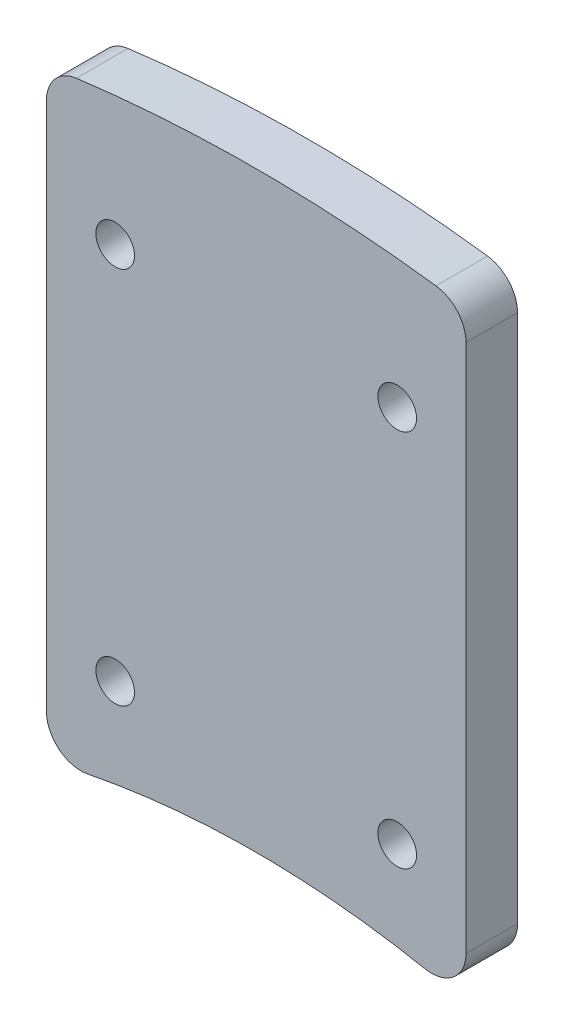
ISO-10303-21;
HEADER;
FILE_DESCRIPTION(('STEP AP214'),'2;1');
FILE_NAME('part.step','',(''),(''),'','','');
FILE_SCHEMA(('AUTOMOTIVE_DESIGN { 1 0 10303 214 1 1 1 1 }'));
ENDSEC;
DATA;
#1=APPLICATION_CONTEXT('core data for automotive mechanical design processes');
#2=APPLICATION_PROTOCOL_DEFINITION('international standard','automotive_design',2000,#1);
#3=PRODUCT_CONTEXT('',#1,'mechanical');
#4=PRODUCT('Part','Part','',(#3));
#5=PRODUCT_RELATED_PRODUCT_CATEGORY('part','',(#4));
#6=PRODUCT_DEFINITION_FORMATION('','',#4);
#7=PRODUCT_DEFINITION_CONTEXT('part definition',#1,'design');
#8=PRODUCT_DEFINITION('design','',#6,#7);
#9=PRODUCT_DEFINITION_SHAPE('','',#8);
#10=(LENGTH_UNIT() NAMED_UNIT(*) SI_UNIT(.MILLI.,.METRE.));
#11=(NAMED_UNIT(*) PLANE_ANGLE_UNIT() SI_UNIT($,.RADIAN.));
#12=(NAMED_UNIT(*) SI_UNIT($,.STERADIAN.) SOLID_ANGLE_UNIT());
#13=UNCERTAINTY_MEASURE_WITH_UNIT(LENGTH_MEASURE(1.E-05),#10,'distance_accuracy_value','');
#14=(GEOMETRIC_REPRESENTATION_CONTEXT(3) GLOBAL_UNCERTAINTY_ASSIGNED_CONTEXT((#13)) GLOBAL_UNIT_ASSIGNED_CONTEXT((#10,
#11,#12)) REPRESENTATION_CONTEXT('',''));
#15=CARTESIAN_POINT('',(0.,0.,0.));
#16=DIRECTION('',(0.,0.,1.));
#17=DIRECTION('',(1.,0.,0.));
#18=AXIS2_PLACEMENT_3D('',#15,#16,#17);
#19=CARTESIAN_POINT('',(77.47,0.,9.525));
#20=DIRECTION('',(-1.,0.,0.));
#21=DIRECTION('',(0.,-1.,0.));
#22=AXIS2_PLACEMENT_3D('',#19,#20,#21);
#23=PLANE('',#22);
#24=DIRECTION('',(0.,1.,0.));
#25=VECTOR('',#24,1.);
#26=CARTESIAN_POINT('',(77.47,0.,0.));
#27=LINE('',#26,#25);
#28=CARTESIAN_POINT('',(77.47,20.6124838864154,0.));
#29=VERTEX_POINT('',#28);
#30=CARTESIAN_POINT('',(77.47,118.304460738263,0.));
#31=VERTEX_POINT('',#30);
#32=EDGE_CURVE('E171',#29,#31,#27,.T.);
#33=ORIENTED_EDGE('',*,*,#32,.T.);
#34=DIRECTION('',(0.,0.,-1.));
#35=VECTOR('',#34,1.);
#36=CARTESIAN_POINT('',(77.47,118.304460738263,9.525));
#37=LINE('',#36,#35);
#38=CARTESIAN_POINT('',(77.47,118.304460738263,9.525));
#39=VERTEX_POINT('',#38);
#40=EDGE_CURVE('E103',#31,#39,#37,.F.);
#41=ORIENTED_EDGE('',*,*,#40,.T.);
#42=DIRECTION('',(0.,1.,0.));
#43=VECTOR('',#42,1.);
#44=CARTESIAN_POINT('',(77.47,0.,9.525));
#45=LINE('',#44,#43);
#46=CARTESIAN_POINT('',(77.47,20.6124838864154,9.525));
#47=VERTEX_POINT('',#46);
#48=EDGE_CURVE('E125',#47,#39,#45,.T.);
#49=ORIENTED_EDGE('',*,*,#48,.F.);
#50=DIRECTION('',(0.,0.,1.));
#51=VECTOR('',#50,1.);
#52=CARTESIAN_POINT('',(77.47,20.6124838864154,9.525));
#53=LINE('',#52,#51);
#54=EDGE_CURVE('E108',#47,#29,#53,.F.);
#55=ORIENTED_EDGE('',*,*,#54,.T.);
#56=EDGE_LOOP('',(#33,#41,#49,#55));
#57=FACE_BOUND('',#56,.T.);
#58=ADVANCED_FACE('F32',(#57),#23,.F.);
#59=CARTESIAN_POINT('',(0.,0.,9.525));
#60=DIRECTION('',(1.,0.,0.));
#61=DIRECTION('',(0.,1.,0.));
#62=AXIS2_PLACEMENT_3D('',#59,#60,#61);
#63=PLANE('',#62);
#64=DIRECTION('',(0.,-1.,0.));
#65=VECTOR('',#64,1.);
#66=CARTESIAN_POINT('',(0.,0.,9.525));
#67=LINE('',#66,#65);
#68=CARTESIAN_POINT('',(0.,118.304460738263,9.525));
#69=VERTEX_POINT('',#68);
#70=CARTESIAN_POINT('',(0.,20.6124838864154,9.525));
#71=VERTEX_POINT('',#70);
#72=EDGE_CURVE('E129',#69,#71,#67,.T.);
#73=ORIENTED_EDGE('',*,*,#72,.F.);
#74=DIRECTION('',(0.,0.,-1.));
#75=VECTOR('',#74,1.);
#76=CARTESIAN_POINT('',(0.,118.304460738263,9.525));
#77=LINE('',#76,#75);
#78=CARTESIAN_POINT('',(0.,118.304460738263,0.));
#79=VERTEX_POINT('',#78);
#80=EDGE_CURVE('E148',#69,#79,#77,.T.);
#81=ORIENTED_EDGE('',*,*,#80,.T.);
#82=DIRECTION('',(0.,-1.,0.));
#83=VECTOR('',#82,1.);
#84=CARTESIAN_POINT('',(0.,0.,0.));
#85=LINE('',#84,#83);
#86=CARTESIAN_POINT('',(0.,20.6124838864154,0.));
#87=VERTEX_POINT('',#86);
#88=EDGE_CURVE('E168',#79,#87,#85,.T.);
#89=ORIENTED_EDGE('',*,*,#88,.T.);
#90=DIRECTION('',(0.,0.,1.));
#91=VECTOR('',#90,1.);
#92=CARTESIAN_POINT('',(0.,20.6124838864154,9.525));
#93=LINE('',#92,#91);
#94=EDGE_CURVE('E145',#87,#71,#93,.T.);
#95=ORIENTED_EDGE('',*,*,#94,.T.);
#96=EDGE_LOOP('',(#73,#81,#89,#95));
#97=FACE_BOUND('',#96,.T.);
#98=ADVANCED_FACE('F34',(#97),#63,.F.);
#99=CARTESIAN_POINT('',(0.,139.7,9.525));
#100=DIRECTION('',(0.,0.,-1.));
#101=DIRECTION('',(-1.,0.,0.));
#102=AXIS2_PLACEMENT_3D('',#99,#100,#101);
#103=PLANE('',#102);
#104=CARTESIAN_POINT('',(64.77,101.6,9.525));
#105=DIRECTION('',(0.,0.,1.));
#106=DIRECTION('',(-1.,0.,0.));
#107=AXIS2_PLACEMENT_3D('',#104,#105,#106);
#108=CIRCLE('',#107,3.56870000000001);
#109=CARTESIAN_POINT('',(68.3387,101.6,9.525));
#110=VERTEX_POINT('',#109);
#111=EDGE_CURVE('E161',#110,#110,#108,.T.);
#112=ORIENTED_EDGE('',*,*,#111,.F.);
#113=EDGE_LOOP('',(#112));
#114=FACE_BOUND('',#113,.T.);
#115=CARTESIAN_POINT('',(12.7,31.75,9.525));
#116=DIRECTION('',(0.,0.,1.));
#117=DIRECTION('',(1.,0.,0.));
#118=AXIS2_PLACEMENT_3D('',#115,#116,#117);
#119=CIRCLE('',#118,3.5687);
#120=CARTESIAN_POINT('',(16.2687,31.75,9.525));
#121=VERTEX_POINT('',#120);
#122=EDGE_CURVE('E190',#121,#121,#119,.T.);
#123=ORIENTED_EDGE('',*,*,#122,.F.);
#124=EDGE_LOOP('',(#123));
#125=FACE_BOUND('',#124,.T.);
#126=CARTESIAN_POINT('',(64.77,31.75,9.525));
#127=DIRECTION('',(0.,0.,1.));
#128=DIRECTION('',(-1.,0.,0.));
#129=AXIS2_PLACEMENT_3D('',#126,#127,#128);
#130=CIRCLE('',#129,3.56870000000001);
#131=CARTESIAN_POINT('',(68.3387,31.75,9.525));
#132=VERTEX_POINT('',#131);
#133=EDGE_CURVE('E184',#132,#132,#130,.T.);
#134=ORIENTED_EDGE('',*,*,#133,.F.);
#135=EDGE_LOOP('',(#134));
#136=FACE_BOUND('',#135,.T.);
#137=CARTESIAN_POINT('',(12.7,101.6,9.525));
#138=DIRECTION('',(0.,0.,1.));
#139=DIRECTION('',(1.,0.,0.));
#140=AXIS2_PLACEMENT_3D('',#137,#138,#139);
#141=CIRCLE('',#140,3.5687);
#142=CARTESIAN_POINT('',(16.2687,101.6,9.525));
#143=VERTEX_POINT('',#142);
#144=EDGE_CURVE('E178',#143,#143,#141,.T.);
#145=ORIENTED_EDGE('',*,*,#144,.F.);
#146=EDGE_LOOP('',(#145));
#147=FACE_BOUND('',#146,.T.);
#148=ORIENTED_EDGE('',*,*,#48,.T.);
#149=CARTESIAN_POINT('',(71.12,118.304460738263,9.525));
#150=DIRECTION('',(0.,0.,-1.));
#151=DIRECTION('',(-1.,0.,0.));
#152=AXIS2_PLACEMENT_3D('',#149,#150,#151);
#153=CIRCLE('',#152,6.35);
#154=CARTESIAN_POINT('',(71.9347169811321,124.60197899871,9.525));
#155=VERTEX_POINT('',#154);
#156=EDGE_CURVE('E143',#39,#155,#153,.F.);
#157=ORIENTED_EDGE('',*,*,#156,.T.);
#158=CARTESIAN_POINT('',(38.735,-132.021890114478,9.525));
#159=DIRECTION('',(0.,0.,1.));
#160=DIRECTION('',(1.,0.,0.));
#161=AXIS2_PLACEMENT_3D('',#158,#159,#160);
#162=CIRCLE('',#161,258.7625);
#163=CARTESIAN_POINT('',(5.53528301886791,124.60197899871,9.525));
#164=VERTEX_POINT('',#163);
#165=EDGE_CURVE('E118',#155,#164,#162,.T.);
#166=ORIENTED_EDGE('',*,*,#165,.T.);
#167=CARTESIAN_POINT('',(6.34999999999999,118.304460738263,9.525));
#168=DIRECTION('',(0.,0.,-1.));
#169=DIRECTION('',(-1.,0.,0.));
#170=AXIS2_PLACEMENT_3D('',#167,#168,#169);
#171=CIRCLE('',#170,6.35);
#172=EDGE_CURVE('E141',#164,#69,#171,.F.);
#173=ORIENTED_EDGE('',*,*,#172,.T.);
#174=ORIENTED_EDGE('',*,*,#72,.T.);
#175=CARTESIAN_POINT('',(6.35000000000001,20.6124838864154,9.525));
#176=DIRECTION('',(0.,0.,-1.));
#177=DIRECTION('',(-1.,0.,0.));
#178=AXIS2_PLACEMENT_3D('',#175,#176,#177);
#179=CIRCLE('',#178,6.35);
#180=CARTESIAN_POINT('',(7.57670454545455,14.3820989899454,9.525));
#181=VERTEX_POINT('',#180);
#182=EDGE_CURVE('E47',#71,#181,#179,.F.);
#183=ORIENTED_EDGE('',*,*,#182,.T.);
#184=CARTESIAN_POINT('',(38.735,-143.869677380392,9.525));
#185=DIRECTION('',(0.,0.,1.));
#186=DIRECTION('',(1.,0.,0.));
#187=AXIS2_PLACEMENT_3D('',#184,#185,#186);
#188=CIRCLE('',#187,161.29);
#189=CARTESIAN_POINT('',(69.8932954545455,14.3820989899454,9.525));
#190=VERTEX_POINT('',#189);
#191=EDGE_CURVE('E156',#190,#181,#188,.T.);
#192=ORIENTED_EDGE('',*,*,#191,.F.);
#193=CARTESIAN_POINT('',(71.12,20.6124838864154,9.525));
#194=DIRECTION('',(0.,0.,-1.));
#195=DIRECTION('',(-1.,0.,0.));
#196=AXIS2_PLACEMENT_3D('',#193,#194,#195);
#197=CIRCLE('',#196,6.35);
#198=EDGE_CURVE('E55',#190,#47,#197,.F.);
#199=ORIENTED_EDGE('',*,*,#198,.T.);
#200=EDGE_LOOP('',(#148,#157,#166,#173,#174,#183,#192,#199));
#201=FACE_BOUND('',#200,.T.);
#202=ADVANCED_FACE('F169',(#114,#125,#136,#147,#201),#103,.F.);
#203=CARTESIAN_POINT('',(0.,139.7,0.));
#204=DIRECTION('',(0.,0.,-1.));
#205=DIRECTION('',(-1.,0.,0.));
#206=AXIS2_PLACEMENT_3D('',#203,#204,#205);
#207=PLANE('',#206);
#208=CARTESIAN_POINT('',(38.735,-132.021890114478,0.));
#209=DIRECTION('',(0.,0.,-1.));
#210=DIRECTION('',(-1.,0.,0.));
#211=AXIS2_PLACEMENT_3D('',#208,#209,#210);
#212=CIRCLE('',#211,258.7625);
#213=CARTESIAN_POINT('',(71.9347169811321,124.60197899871,0.));
#214=VERTEX_POINT('',#213);
#215=CARTESIAN_POINT('',(5.53528301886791,124.60197899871,0.));
#216=VERTEX_POINT('',#215);
#217=EDGE_CURVE('E115',#214,#216,#212,.F.);
#218=ORIENTED_EDGE('',*,*,#217,.F.);
#219=CARTESIAN_POINT('',(71.12,118.304460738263,0.));
#220=DIRECTION('',(0.,0.,-1.));
#221=DIRECTION('',(-1.,0.,0.));
#222=AXIS2_PLACEMENT_3D('',#219,#220,#221);
#223=CIRCLE('',#222,6.35);
#224=EDGE_CURVE('E98',#214,#31,#223,.T.);
#225=ORIENTED_EDGE('',*,*,#224,.T.);
#226=ORIENTED_EDGE('',*,*,#32,.F.);
#227=CARTESIAN_POINT('',(71.12,20.6124838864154,0.));
#228=DIRECTION('',(0.,0.,-1.));
#229=DIRECTION('',(-1.,0.,0.));
#230=AXIS2_PLACEMENT_3D('',#227,#228,#229);
#231=CIRCLE('',#230,6.35);
#232=CARTESIAN_POINT('',(69.8932954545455,14.3820989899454,0.));
#233=VERTEX_POINT('',#232);
#234=EDGE_CURVE('E134',#29,#233,#231,.T.);
#235=ORIENTED_EDGE('',*,*,#234,.T.);
#236=CARTESIAN_POINT('',(38.735,-143.869677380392,0.));
#237=DIRECTION('',(0.,0.,1.));
#238=DIRECTION('',(1.,0.,0.));
#239=AXIS2_PLACEMENT_3D('',#236,#237,#238);
#240=CIRCLE('',#239,161.29);
#241=CARTESIAN_POINT('',(7.57670454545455,14.3820989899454,0.));
#242=VERTEX_POINT('',#241);
#243=EDGE_CURVE('E155',#233,#242,#240,.T.);
#244=ORIENTED_EDGE('',*,*,#243,.T.);
#245=CARTESIAN_POINT('',(6.35000000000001,20.6124838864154,0.));
#246=DIRECTION('',(0.,0.,-1.));
#247=DIRECTION('',(-1.,0.,0.));
#248=AXIS2_PLACEMENT_3D('',#245,#246,#247);
#249=CIRCLE('',#248,6.35);
#250=EDGE_CURVE('E119',#242,#87,#249,.T.);
#251=ORIENTED_EDGE('',*,*,#250,.T.);
#252=ORIENTED_EDGE('',*,*,#88,.F.);
#253=CARTESIAN_POINT('',(6.34999999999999,118.304460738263,0.));
#254=DIRECTION('',(0.,0.,-1.));
#255=DIRECTION('',(-1.,0.,0.));
#256=AXIS2_PLACEMENT_3D('',#253,#254,#255);
#257=CIRCLE('',#256,6.35);
#258=EDGE_CURVE('E109',#79,#216,#257,.T.);
#259=ORIENTED_EDGE('',*,*,#258,.T.);
#260=EDGE_LOOP('',(#218,#225,#226,#235,#244,#251,#252,#259));
#261=FACE_BOUND('',#260,.T.);
#262=CARTESIAN_POINT('',(64.77,101.6,0.));
#263=DIRECTION('',(0.,0.,1.));
#264=DIRECTION('',(-1.,0.,0.));
#265=AXIS2_PLACEMENT_3D('',#262,#263,#264);
#266=CIRCLE('',#265,3.56870000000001);
#267=CARTESIAN_POINT('',(68.3387,101.6,0.));
#268=VERTEX_POINT('',#267);
#269=EDGE_CURVE('E193',#268,#268,#266,.T.);
#270=ORIENTED_EDGE('',*,*,#269,.T.);
#271=EDGE_LOOP('',(#270));
#272=FACE_BOUND('',#271,.T.);
#273=CARTESIAN_POINT('',(12.7,31.75,0.));
#274=DIRECTION('',(0.,0.,1.));
#275=DIRECTION('',(1.,0.,0.));
#276=AXIS2_PLACEMENT_3D('',#273,#274,#275);
#277=CIRCLE('',#276,3.5687);
#278=CARTESIAN_POINT('',(16.2687,31.75,0.));
#279=VERTEX_POINT('',#278);
#280=EDGE_CURVE('E187',#279,#279,#277,.T.);
#281=ORIENTED_EDGE('',*,*,#280,.T.);
#282=EDGE_LOOP('',(#281));
#283=FACE_BOUND('',#282,.T.);
#284=CARTESIAN_POINT('',(64.77,31.75,0.));
#285=DIRECTION('',(0.,0.,1.));
#286=DIRECTION('',(-1.,0.,0.));
#287=AXIS2_PLACEMENT_3D('',#284,#285,#286);
#288=CIRCLE('',#287,3.56870000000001);
#289=CARTESIAN_POINT('',(68.3387,31.75,0.));
#290=VERTEX_POINT('',#289);
#291=EDGE_CURVE('E181',#290,#290,#288,.T.);
#292=ORIENTED_EDGE('',*,*,#291,.T.);
#293=EDGE_LOOP('',(#292));
#294=FACE_BOUND('',#293,.T.);
#295=CARTESIAN_POINT('',(12.7,101.6,0.));
#296=DIRECTION('',(0.,0.,1.));
#297=DIRECTION('',(1.,0.,0.));
#298=AXIS2_PLACEMENT_3D('',#295,#296,#297);
#299=CIRCLE('',#298,3.5687);
#300=CARTESIAN_POINT('',(16.2687,101.6,0.));
#301=VERTEX_POINT('',#300);
#302=EDGE_CURVE('E175',#301,#301,#299,.T.);
#303=ORIENTED_EDGE('',*,*,#302,.T.);
#304=EDGE_LOOP('',(#303));
#305=FACE_BOUND('',#304,.T.);
#306=ADVANCED_FACE('F122',(#261,#272,#283,#294,#305),#207,.T.);
#307=CARTESIAN_POINT('',(12.7,101.6,0.));
#308=DIRECTION('',(0.,0.,1.));
#309=DIRECTION('',(1.,0.,0.));
#310=AXIS2_PLACEMENT_3D('',#307,#308,#309);
#311=CYLINDRICAL_SURFACE('',#310,3.5687);
#312=CARTESIAN_POINT('',(16.2687,101.6,0.));
#313=CARTESIAN_POINT('',(16.2687,101.6,0.0992187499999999));
#314=CARTESIAN_POINT('',(16.2687,101.6,0.1984375));
#315=CARTESIAN_POINT('',(16.2687,101.6,0.396875));
#316=CARTESIAN_POINT('',(16.2687,101.6,0.49609375));
#317=CARTESIAN_POINT('',(16.2687,101.6,0.69453125));
#318=CARTESIAN_POINT('',(16.2687,101.6,0.79375));
#319=CARTESIAN_POINT('',(16.2687,101.6,0.9921875));
#320=CARTESIAN_POINT('',(16.2687,101.6,1.09140625));
#321=CARTESIAN_POINT('',(16.2687,101.6,1.28984375));
#322=CARTESIAN_POINT('',(16.2687,101.6,1.3890625));
#323=CARTESIAN_POINT('',(16.2687,101.6,1.5875));
#324=CARTESIAN_POINT('',(16.2687,101.6,1.68671875));
#325=CARTESIAN_POINT('',(16.2687,101.6,1.88515625));
#326=CARTESIAN_POINT('',(16.2687,101.6,1.984375));
#327=CARTESIAN_POINT('',(16.2687,101.6,2.1828125));
#328=CARTESIAN_POINT('',(16.2687,101.6,2.28203125));
#329=CARTESIAN_POINT('',(16.2687,101.6,2.48046875));
#330=CARTESIAN_POINT('',(16.2687,101.6,2.5796875));
#331=CARTESIAN_POINT('',(16.2687,101.6,2.778125));
#332=CARTESIAN_POINT('',(16.2687,101.6,2.87734375));
#333=CARTESIAN_POINT('',(16.2687,101.6,3.07578125));
#334=CARTESIAN_POINT('',(16.2687,101.6,3.175));
#335=CARTESIAN_POINT('',(16.2687,101.6,3.3734375));
#336=CARTESIAN_POINT('',(16.2687,101.6,3.47265625));
#337=CARTESIAN_POINT('',(16.2687,101.6,3.67109375));
#338=CARTESIAN_POINT('',(16.2687,101.6,3.7703125));
#339=CARTESIAN_POINT('',(16.2687,101.6,3.96875));
#340=CARTESIAN_POINT('',(16.2687,101.6,4.06796875));
#341=CARTESIAN_POINT('',(16.2687,101.6,4.26640625));
#342=CARTESIAN_POINT('',(16.2687,101.6,4.365625));
#343=CARTESIAN_POINT('',(16.2687,101.6,4.5640625));
#344=CARTESIAN_POINT('',(16.2687,101.6,4.66328125));
#345=CARTESIAN_POINT('',(16.2687,101.6,4.86171875));
#346=CARTESIAN_POINT('',(16.2687,101.6,4.9609375));
#347=CARTESIAN_POINT('',(16.2687,101.6,5.159375));
#348=CARTESIAN_POINT('',(16.2687,101.6,5.25859375));
#349=CARTESIAN_POINT('',(16.2687,101.6,5.45703125));
#350=CARTESIAN_POINT('',(16.2687,101.6,5.55625));
#351=CARTESIAN_POINT('',(16.2687,101.6,5.7546875));
#352=CARTESIAN_POINT('',(16.2687,101.6,5.85390625));
#353=CARTESIAN_POINT('',(16.2687,101.6,6.05234375));
#354=CARTESIAN_POINT('',(16.2687,101.6,6.1515625));
#355=CARTESIAN_POINT('',(16.2687,101.6,6.35));
#356=CARTESIAN_POINT('',(16.2687,101.6,6.44921875));
#357=CARTESIAN_POINT('',(16.2687,101.6,6.64765625));
#358=CARTESIAN_POINT('',(16.2687,101.6,6.746875));
#359=CARTESIAN_POINT('',(16.2687,101.6,6.9453125));
#360=CARTESIAN_POINT('',(16.2687,101.6,7.04453125));
#361=CARTESIAN_POINT('',(16.2687,101.6,7.24296875));
#362=CARTESIAN_POINT('',(16.2687,101.6,7.3421875));
#363=CARTESIAN_POINT('',(16.2687,101.6,7.540625));
#364=CARTESIAN_POINT('',(16.2687,101.6,7.63984375));
#365=CARTESIAN_POINT('',(16.2687,101.6,7.83828125));
#366=CARTESIAN_POINT('',(16.2687,101.6,7.9375));
#367=CARTESIAN_POINT('',(16.2687,101.6,8.1359375));
#368=CARTESIAN_POINT('',(16.2687,101.6,8.23515625));
#369=CARTESIAN_POINT('',(16.2687,101.6,8.43359375));
#370=CARTESIAN_POINT('',(16.2687,101.6,8.5328125));
#371=CARTESIAN_POINT('',(16.2687,101.6,8.73125));
#372=CARTESIAN_POINT('',(16.2687,101.6,8.83046875));
#373=CARTESIAN_POINT('',(16.2687,101.6,9.02890625));
#374=CARTESIAN_POINT('',(16.2687,101.6,9.128125));
#375=CARTESIAN_POINT('',(16.2687,101.6,9.3265625));
#376=CARTESIAN_POINT('',(16.2687,101.6,9.42578125));
#377=CARTESIAN_POINT('',(16.2687,101.6,9.525));
#378=B_SPLINE_CURVE_WITH_KNOTS('',3,(#312,#313,#314,#315,#316,#317,#318,#319,#320,#321,#322,
#323,#324,#325,#326,#327,#328,#329,#330,#331,#332,#333,#334,#335,#336,#337,#338,#339,#340,#341,
#342,#343,#344,#345,#346,#347,#348,#349,#350,#351,#352,#353,#354,#355,#356,#357,#358,#359,#360,
#361,#362,#363,#364,#365,#366,#367,#368,#369,#370,#371,#372,#373,#374,#375,#376,#377),
.UNSPECIFIED.,.F.,.F.,(4,2,2,2,2,2,2,2,2,2,2,2,2,2,2,2,2,2,2,2,2,2,2,2,2,2,2,2,2,2,2,2,4),(0.,
0.29765625,0.5953125,0.89296875,1.190625,1.48828125,1.7859375,2.08359375,2.38125,2.67890625,
2.9765625,3.27421875,3.571875,3.86953125,4.1671875,4.46484375,4.7625,5.06015625,5.3578125,
5.65546875,5.953125,6.25078125,6.5484375,6.84609375,7.14375,7.44140625,7.7390625,8.03671875,
8.334375,8.63203125,8.9296875,9.22734375,9.525),.UNSPECIFIED.);
#379=EDGE_CURVE('BSEAM221',#301,#143,#378,.T.);
#380=ORIENTED_EDGE('',*,*,#302,.F.);
#381=ORIENTED_EDGE('',*,*,#144,.T.);
#382=ORIENTED_EDGE('',*,*,#379,.T.);
#383=ORIENTED_EDGE('',*,*,#379,.F.);
#384=EDGE_LOOP('',(#380,#382,#381,#383));
#385=FACE_BOUND('',#384,.T.);
#386=ADVANCED_FACE('F221',(#385),#311,.F.);
#387=CARTESIAN_POINT('',(64.77,31.75,0.));
#388=DIRECTION('',(0.,0.,1.));
#389=DIRECTION('',(1.,0.,0.));
#390=AXIS2_PLACEMENT_3D('',#387,#388,#389);
#391=CYLINDRICAL_SURFACE('',#390,3.56870000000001);
#392=CARTESIAN_POINT('',(68.3387,31.75,0.));
#393=CARTESIAN_POINT('',(68.3387,31.75,0.0992187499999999));
#394=CARTESIAN_POINT('',(68.3387,31.75,0.1984375));
#395=CARTESIAN_POINT('',(68.3387,31.75,0.396875));
#396=CARTESIAN_POINT('',(68.3387,31.75,0.49609375));
#397=CARTESIAN_POINT('',(68.3387,31.75,0.69453125));
#398=CARTESIAN_POINT('',(68.3387,31.75,0.79375));
#399=CARTESIAN_POINT('',(68.3387,31.75,0.9921875));
#400=CARTESIAN_POINT('',(68.3387,31.75,1.09140625));
#401=CARTESIAN_POINT('',(68.3387,31.75,1.28984375));
#402=CARTESIAN_POINT('',(68.3387,31.75,1.3890625));
#403=CARTESIAN_POINT('',(68.3387,31.75,1.5875));
#404=CARTESIAN_POINT('',(68.3387,31.75,1.68671875));
#405=CARTESIAN_POINT('',(68.3387,31.75,1.88515625));
#406=CARTESIAN_POINT('',(68.3387,31.75,1.984375));
#407=CARTESIAN_POINT('',(68.3387,31.75,2.1828125));
#408=CARTESIAN_POINT('',(68.3387,31.75,2.28203125));
#409=CARTESIAN_POINT('',(68.3387,31.75,2.48046875));
#410=CARTESIAN_POINT('',(68.3387,31.75,2.5796875));
#411=CARTESIAN_POINT('',(68.3387,31.75,2.778125));
#412=CARTESIAN_POINT('',(68.3387,31.75,2.87734375));
#413=CARTESIAN_POINT('',(68.3387,31.75,3.07578125));
#414=CARTESIAN_POINT('',(68.3387,31.75,3.175));
#415=CARTESIAN_POINT('',(68.3387,31.75,3.3734375));
#416=CARTESIAN_POINT('',(68.3387,31.75,3.47265625));
#417=CARTESIAN_POINT('',(68.3387,31.75,3.67109375));
#418=CARTESIAN_POINT('',(68.3387,31.75,3.7703125));
#419=CARTESIAN_POINT('',(68.3387,31.75,3.96875));
#420=CARTESIAN_POINT('',(68.3387,31.75,4.06796875));
#421=CARTESIAN_POINT('',(68.3387,31.75,4.26640625));
#422=CARTESIAN_POINT('',(68.3387,31.75,4.365625));
#423=CARTESIAN_POINT('',(68.3387,31.75,4.5640625));
#424=CARTESIAN_POINT('',(68.3387,31.75,4.66328125));
#425=CARTESIAN_POINT('',(68.3387,31.75,4.86171875));
#426=CARTESIAN_POINT('',(68.3387,31.75,4.9609375));
#427=CARTESIAN_POINT('',(68.3387,31.75,5.159375));
#428=CARTESIAN_POINT('',(68.3387,31.75,5.25859375));
#429=CARTESIAN_POINT('',(68.3387,31.75,5.45703125));
#430=CARTESIAN_POINT('',(68.3387,31.75,5.55625));
#431=CARTESIAN_POINT('',(68.3387,31.75,5.7546875));
#432=CARTESIAN_POINT('',(68.3387,31.75,5.85390625));
#433=CARTESIAN_POINT('',(68.3387,31.75,6.05234375));
#434=CARTESIAN_POINT('',(68.3387,31.75,6.1515625));
#435=CARTESIAN_POINT('',(68.3387,31.75,6.35));
#436=CARTESIAN_POINT('',(68.3387,31.75,6.44921875));
#437=CARTESIAN_POINT('',(68.3387,31.75,6.64765625));
#438=CARTESIAN_POINT('',(68.3387,31.75,6.746875));
#439=CARTESIAN_POINT('',(68.3387,31.75,6.9453125));
#440=CARTESIAN_POINT('',(68.3387,31.75,7.04453125));
#441=CARTESIAN_POINT('',(68.3387,31.75,7.24296875));
#442=CARTESIAN_POINT('',(68.3387,31.75,7.3421875));
#443=CARTESIAN_POINT('',(68.3387,31.75,7.540625));
#444=CARTESIAN_POINT('',(68.3387,31.75,7.63984375));
#445=CARTESIAN_POINT('',(68.3387,31.75,7.83828125));
#446=CARTESIAN_POINT('',(68.3387,31.75,7.9375));
#447=CARTESIAN_POINT('',(68.3387,31.75,8.1359375));
#448=CARTESIAN_POINT('',(68.3387,31.75,8.23515625));
#449=CARTESIAN_POINT('',(68.3387,31.75,8.43359375));
#450=CARTESIAN_POINT('',(68.3387,31.75,8.5328125));
#451=CARTESIAN_POINT('',(68.3387,31.75,8.73125));
#452=CARTESIAN_POINT('',(68.3387,31.75,8.83046875));
#453=CARTESIAN_POINT('',(68.3387,31.75,9.02890625));
#454=CARTESIAN_POINT('',(68.3387,31.75,9.128125));
#455=CARTESIAN_POINT('',(68.3387,31.75,9.3265625));
#456=CARTESIAN_POINT('',(68.3387,31.75,9.42578125));
#457=CARTESIAN_POINT('',(68.3387,31.75,9.525));
#458=B_SPLINE_CURVE_WITH_KNOTS('',3,(#392,#393,#394,#395,#396,#397,#398,#399,#400,#401,#402,
#403,#404,#405,#406,#407,#408,#409,#410,#411,#412,#413,#414,#415,#416,#417,#418,#419,#420,#421,
#422,#423,#424,#425,#426,#427,#428,#429,#430,#431,#432,#433,#434,#435,#436,#437,#438,#439,#440,
#441,#442,#443,#444,#445,#446,#447,#448,#449,#450,#451,#452,#453,#454,#455,#456,#457),
.UNSPECIFIED.,.F.,.F.,(4,2,2,2,2,2,2,2,2,2,2,2,2,2,2,2,2,2,2,2,2,2,2,2,2,2,2,2,2,2,2,2,4),(0.,
0.29765625,0.5953125,0.89296875,1.190625,1.48828125,1.7859375,2.08359375,2.38125,2.67890625,
2.9765625,3.27421875,3.571875,3.86953125,4.1671875,4.46484375,4.7625,5.06015625,5.3578125,
5.65546875,5.953125,6.25078125,6.5484375,6.84609375,7.14375,7.44140625,7.7390625,8.03671875,
8.334375,8.63203125,8.9296875,9.22734375,9.525),.UNSPECIFIED.);
#459=EDGE_CURVE('BSEAM224',#290,#132,#458,.T.);
#460=ORIENTED_EDGE('',*,*,#291,.F.);
#461=ORIENTED_EDGE('',*,*,#133,.T.);
#462=ORIENTED_EDGE('',*,*,#459,.T.);
#463=ORIENTED_EDGE('',*,*,#459,.F.);
#464=EDGE_LOOP('',(#460,#462,#461,#463));
#465=FACE_BOUND('',#464,.T.);
#466=ADVANCED_FACE('F224',(#465),#391,.F.);
#467=CARTESIAN_POINT('',(12.7,31.75,0.));
#468=DIRECTION('',(0.,0.,1.));
#469=DIRECTION('',(1.,0.,0.));
#470=AXIS2_PLACEMENT_3D('',#467,#468,#469);
#471=CYLINDRICAL_SURFACE('',#470,3.5687);
#472=CARTESIAN_POINT('',(16.2687,31.75,0.));
#473=CARTESIAN_POINT('',(16.2687,31.75,0.0992187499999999));
#474=CARTESIAN_POINT('',(16.2687,31.75,0.1984375));
#475=CARTESIAN_POINT('',(16.2687,31.75,0.396875));
#476=CARTESIAN_POINT('',(16.2687,31.75,0.49609375));
#477=CARTESIAN_POINT('',(16.2687,31.75,0.69453125));
#478=CARTESIAN_POINT('',(16.2687,31.75,0.79375));
#479=CARTESIAN_POINT('',(16.2687,31.75,0.9921875));
#480=CARTESIAN_POINT('',(16.2687,31.75,1.09140625));
#481=CARTESIAN_POINT('',(16.2687,31.75,1.28984375));
#482=CARTESIAN_POINT('',(16.2687,31.75,1.3890625));
#483=CARTESIAN_POINT('',(16.2687,31.75,1.5875));
#484=CARTESIAN_POINT('',(16.2687,31.75,1.68671875));
#485=CARTESIAN_POINT('',(16.2687,31.75,1.88515625));
#486=CARTESIAN_POINT('',(16.2687,31.75,1.984375));
#487=CARTESIAN_POINT('',(16.2687,31.75,2.1828125));
#488=CARTESIAN_POINT('',(16.2687,31.75,2.28203125));
#489=CARTESIAN_POINT('',(16.2687,31.75,2.48046875));
#490=CARTESIAN_POINT('',(16.2687,31.75,2.5796875));
#491=CARTESIAN_POINT('',(16.2687,31.75,2.778125));
#492=CARTESIAN_POINT('',(16.2687,31.75,2.87734375));
#493=CARTESIAN_POINT('',(16.2687,31.75,3.07578125));
#494=CARTESIAN_POINT('',(16.2687,31.75,3.175));
#495=CARTESIAN_POINT('',(16.2687,31.75,3.3734375));
#496=CARTESIAN_POINT('',(16.2687,31.75,3.47265625));
#497=CARTESIAN_POINT('',(16.2687,31.75,3.67109375));
#498=CARTESIAN_POINT('',(16.2687,31.75,3.7703125));
#499=CARTESIAN_POINT('',(16.2687,31.75,3.96875));
#500=CARTESIAN_POINT('',(16.2687,31.75,4.06796875));
#501=CARTESIAN_POINT('',(16.2687,31.75,4.26640625));
#502=CARTESIAN_POINT('',(16.2687,31.75,4.365625));
#503=CARTESIAN_POINT('',(16.2687,31.75,4.5640625));
#504=CARTESIAN_POINT('',(16.2687,31.75,4.66328125));
#505=CARTESIAN_POINT('',(16.2687,31.75,4.86171875));
#506=CARTESIAN_POINT('',(16.2687,31.75,4.9609375));
#507=CARTESIAN_POINT('',(16.2687,31.75,5.159375));
#508=CARTESIAN_POINT('',(16.2687,31.75,5.25859375));
#509=CARTESIAN_POINT('',(16.2687,31.75,5.45703125));
#510=CARTESIAN_POINT('',(16.2687,31.75,5.55625));
#511=CARTESIAN_POINT('',(16.2687,31.75,5.7546875));
#512=CARTESIAN_POINT('',(16.2687,31.75,5.85390625));
#513=CARTESIAN_POINT('',(16.2687,31.75,6.05234375));
#514=CARTESIAN_POINT('',(16.2687,31.75,6.1515625));
#515=CARTESIAN_POINT('',(16.2687,31.75,6.35));
#516=CARTESIAN_POINT('',(16.2687,31.75,6.44921875));
#517=CARTESIAN_POINT('',(16.2687,31.75,6.64765625));
#518=CARTESIAN_POINT('',(16.2687,31.75,6.746875));
#519=CARTESIAN_POINT('',(16.2687,31.75,6.9453125));
#520=CARTESIAN_POINT('',(16.2687,31.75,7.04453125));
#521=CARTESIAN_POINT('',(16.2687,31.75,7.24296875));
#522=CARTESIAN_POINT('',(16.2687,31.75,7.3421875));
#523=CARTESIAN_POINT('',(16.2687,31.75,7.540625));
#524=CARTESIAN_POINT('',(16.2687,31.75,7.63984375));
#525=CARTESIAN_POINT('',(16.2687,31.75,7.83828125));
#526=CARTESIAN_POINT('',(16.2687,31.75,7.9375));
#527=CARTESIAN_POINT('',(16.2687,31.75,8.1359375));
#528=CARTESIAN_POINT('',(16.2687,31.75,8.23515625));
#529=CARTESIAN_POINT('',(16.2687,31.75,8.43359375));
#530=CARTESIAN_POINT('',(16.2687,31.75,8.5328125));
#531=CARTESIAN_POINT('',(16.2687,31.75,8.73125));
#532=CARTESIAN_POINT('',(16.2687,31.75,8.83046875));
#533=CARTESIAN_POINT('',(16.2687,31.75,9.02890625));
#534=CARTESIAN_POINT('',(16.2687,31.75,9.128125));
#535=CARTESIAN_POINT('',(16.2687,31.75,9.3265625));
#536=CARTESIAN_POINT('',(16.2687,31.75,9.42578125));
#537=CARTESIAN_POINT('',(16.2687,31.75,9.525));
#538=B_SPLINE_CURVE_WITH_KNOTS('',3,(#472,#473,#474,#475,#476,#477,#478,#479,#480,#481,#482,
#483,#484,#485,#486,#487,#488,#489,#490,#491,#492,#493,#494,#495,#496,#497,#498,#499,#500,#501,
#502,#503,#504,#505,#506,#507,#508,#509,#510,#511,#512,#513,#514,#515,#516,#517,#518,#519,#520,
#521,#522,#523,#524,#525,#526,#527,#528,#529,#530,#531,#532,#533,#534,#535,#536,#537),
.UNSPECIFIED.,.F.,.F.,(4,2,2,2,2,2,2,2,2,2,2,2,2,2,2,2,2,2,2,2,2,2,2,2,2,2,2,2,2,2,2,2,4),(0.,
0.29765625,0.5953125,0.89296875,1.190625,1.48828125,1.7859375,2.08359375,2.38125,2.67890625,
2.9765625,3.27421875,3.571875,3.86953125,4.1671875,4.46484375,4.7625,5.06015625,5.3578125,
5.65546875,5.953125,6.25078125,6.5484375,6.84609375,7.14375,7.44140625,7.7390625,8.03671875,
8.334375,8.63203125,8.9296875,9.22734375,9.525),.UNSPECIFIED.);
#539=EDGE_CURVE('BSEAM228',#279,#121,#538,.T.);
#540=ORIENTED_EDGE('',*,*,#280,.F.);
#541=ORIENTED_EDGE('',*,*,#122,.T.);
#542=ORIENTED_EDGE('',*,*,#539,.T.);
#543=ORIENTED_EDGE('',*,*,#539,.F.);
#544=EDGE_LOOP('',(#540,#542,#541,#543));
#545=FACE_BOUND('',#544,.T.);
#546=ADVANCED_FACE('F228',(#545),#471,.F.);
#547=CARTESIAN_POINT('',(64.77,101.6,0.));
#548=DIRECTION('',(0.,0.,1.));
#549=DIRECTION('',(1.,0.,0.));
#550=AXIS2_PLACEMENT_3D('',#547,#548,#549);
#551=CYLINDRICAL_SURFACE('',#550,3.56870000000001);
#552=CARTESIAN_POINT('',(68.3387,101.6,0.));
#553=CARTESIAN_POINT('',(68.3387,101.6,0.0992187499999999));
#554=CARTESIAN_POINT('',(68.3387,101.6,0.1984375));
#555=CARTESIAN_POINT('',(68.3387,101.6,0.396875));
#556=CARTESIAN_POINT('',(68.3387,101.6,0.49609375));
#557=CARTESIAN_POINT('',(68.3387,101.6,0.69453125));
#558=CARTESIAN_POINT('',(68.3387,101.6,0.79375));
#559=CARTESIAN_POINT('',(68.3387,101.6,0.9921875));
#560=CARTESIAN_POINT('',(68.3387,101.6,1.09140625));
#561=CARTESIAN_POINT('',(68.3387,101.6,1.28984375));
#562=CARTESIAN_POINT('',(68.3387,101.6,1.3890625));
#563=CARTESIAN_POINT('',(68.3387,101.6,1.5875));
#564=CARTESIAN_POINT('',(68.3387,101.6,1.68671875));
#565=CARTESIAN_POINT('',(68.3387,101.6,1.88515625));
#566=CARTESIAN_POINT('',(68.3387,101.6,1.984375));
#567=CARTESIAN_POINT('',(68.3387,101.6,2.1828125));
#568=CARTESIAN_POINT('',(68.3387,101.6,2.28203125));
#569=CARTESIAN_POINT('',(68.3387,101.6,2.48046875));
#570=CARTESIAN_POINT('',(68.3387,101.6,2.5796875));
#571=CARTESIAN_POINT('',(68.3387,101.6,2.778125));
#572=CARTESIAN_POINT('',(68.3387,101.6,2.87734375));
#573=CARTESIAN_POINT('',(68.3387,101.6,3.07578125));
#574=CARTESIAN_POINT('',(68.3387,101.6,3.175));
#575=CARTESIAN_POINT('',(68.3387,101.6,3.3734375));
#576=CARTESIAN_POINT('',(68.3387,101.6,3.47265625));
#577=CARTESIAN_POINT('',(68.3387,101.6,3.67109375));
#578=CARTESIAN_POINT('',(68.3387,101.6,3.7703125));
#579=CARTESIAN_POINT('',(68.3387,101.6,3.96875));
#580=CARTESIAN_POINT('',(68.3387,101.6,4.06796875));
#581=CARTESIAN_POINT('',(68.3387,101.6,4.26640625));
#582=CARTESIAN_POINT('',(68.3387,101.6,4.365625));
#583=CARTESIAN_POINT('',(68.3387,101.6,4.5640625));
#584=CARTESIAN_POINT('',(68.3387,101.6,4.66328125));
#585=CARTESIAN_POINT('',(68.3387,101.6,4.86171875));
#586=CARTESIAN_POINT('',(68.3387,101.6,4.9609375));
#587=CARTESIAN_POINT('',(68.3387,101.6,5.159375));
#588=CARTESIAN_POINT('',(68.3387,101.6,5.25859375));
#589=CARTESIAN_POINT('',(68.3387,101.6,5.45703125));
#590=CARTESIAN_POINT('',(68.3387,101.6,5.55625));
#591=CARTESIAN_POINT('',(68.3387,101.6,5.7546875));
#592=CARTESIAN_POINT('',(68.3387,101.6,5.85390625));
#593=CARTESIAN_POINT('',(68.3387,101.6,6.05234375));
#594=CARTESIAN_POINT('',(68.3387,101.6,6.1515625));
#595=CARTESIAN_POINT('',(68.3387,101.6,6.35));
#596=CARTESIAN_POINT('',(68.3387,101.6,6.44921875));
#597=CARTESIAN_POINT('',(68.3387,101.6,6.64765625));
#598=CARTESIAN_POINT('',(68.3387,101.6,6.746875));
#599=CARTESIAN_POINT('',(68.3387,101.6,6.9453125));
#600=CARTESIAN_POINT('',(68.3387,101.6,7.04453125));
#601=CARTESIAN_POINT('',(68.3387,101.6,7.24296875));
#602=CARTESIAN_POINT('',(68.3387,101.6,7.3421875));
#603=CARTESIAN_POINT('',(68.3387,101.6,7.540625));
#604=CARTESIAN_POINT('',(68.3387,101.6,7.63984375));
#605=CARTESIAN_POINT('',(68.3387,101.6,7.83828125));
#606=CARTESIAN_POINT('',(68.3387,101.6,7.9375));
#607=CARTESIAN_POINT('',(68.3387,101.6,8.1359375));
#608=CARTESIAN_POINT('',(68.3387,101.6,8.23515625));
#609=CARTESIAN_POINT('',(68.3387,101.6,8.43359375));
#610=CARTESIAN_POINT('',(68.3387,101.6,8.5328125));
#611=CARTESIAN_POINT('',(68.3387,101.6,8.73125));
#612=CARTESIAN_POINT('',(68.3387,101.6,8.83046875));
#613=CARTESIAN_POINT('',(68.3387,101.6,9.02890625));
#614=CARTESIAN_POINT('',(68.3387,101.6,9.128125));
#615=CARTESIAN_POINT('',(68.3387,101.6,9.3265625));
#616=CARTESIAN_POINT('',(68.3387,101.6,9.42578125));
#617=CARTESIAN_POINT('',(68.3387,101.6,9.525));
#618=B_SPLINE_CURVE_WITH_KNOTS('',3,(#552,#553,#554,#555,#556,#557,#558,#559,#560,#561,#562,
#563,#564,#565,#566,#567,#568,#569,#570,#571,#572,#573,#574,#575,#576,#577,#578,#579,#580,#581,
#582,#583,#584,#585,#586,#587,#588,#589,#590,#591,#592,#593,#594,#595,#596,#597,#598,#599,#600,
#601,#602,#603,#604,#605,#606,#607,#608,#609,#610,#611,#612,#613,#614,#615,#616,#617),
.UNSPECIFIED.,.F.,.F.,(4,2,2,2,2,2,2,2,2,2,2,2,2,2,2,2,2,2,2,2,2,2,2,2,2,2,2,2,2,2,2,2,4),(0.,
0.29765625,0.5953125,0.89296875,1.190625,1.48828125,1.7859375,2.08359375,2.38125,2.67890625,
2.9765625,3.27421875,3.571875,3.86953125,4.1671875,4.46484375,4.7625,5.06015625,5.3578125,
5.65546875,5.953125,6.25078125,6.5484375,6.84609375,7.14375,7.44140625,7.7390625,8.03671875,
8.334375,8.63203125,8.9296875,9.22734375,9.525),.UNSPECIFIED.);
#619=EDGE_CURVE('BSEAM232',#268,#110,#618,.T.);
#620=ORIENTED_EDGE('',*,*,#269,.F.);
#621=ORIENTED_EDGE('',*,*,#111,.T.);
#622=ORIENTED_EDGE('',*,*,#619,.T.);
#623=ORIENTED_EDGE('',*,*,#619,.F.);
#624=EDGE_LOOP('',(#620,#622,#621,#623));
#625=FACE_BOUND('',#624,.T.);
#626=ADVANCED_FACE('F232',(#625),#551,.F.);
#627=CARTESIAN_POINT('',(38.735,-143.869677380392,0.));
#628=DIRECTION('',(0.,0.,1.));
#629=DIRECTION('',(1.,0.,0.));
#630=AXIS2_PLACEMENT_3D('',#627,#628,#629);
#631=CYLINDRICAL_SURFACE('',#630,161.29);
#632=ORIENTED_EDGE('',*,*,#243,.F.);
#633=DIRECTION('',(0.,0.,1.));
#634=VECTOR('',#633,1.);
#635=CARTESIAN_POINT('',(69.8932954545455,14.3820989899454,0.));
#636=LINE('',#635,#634);
#637=EDGE_CURVE('E11',#233,#190,#636,.T.);
#638=ORIENTED_EDGE('',*,*,#637,.T.);
#639=ORIENTED_EDGE('',*,*,#191,.T.);
#640=DIRECTION('',(0.,0.,1.));
#641=VECTOR('',#640,1.);
#642=CARTESIAN_POINT('',(7.57670454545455,14.3820989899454,0.));
#643=LINE('',#642,#641);
#644=EDGE_CURVE('E40',#181,#242,#643,.F.);
#645=ORIENTED_EDGE('',*,*,#644,.T.);
#646=EDGE_LOOP('',(#632,#638,#639,#645));
#647=FACE_BOUND('',#646,.T.);
#648=ADVANCED_FACE('F154',(#647),#631,.F.);
#649=CARTESIAN_POINT('',(38.735,-132.021890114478,9.525));
#650=DIRECTION('',(0.,0.,-1.));
#651=DIRECTION('',(-1.,0.,0.));
#652=AXIS2_PLACEMENT_3D('',#649,#650,#651);
#653=CYLINDRICAL_SURFACE('',#652,258.7625);
#654=ORIENTED_EDGE('',*,*,#165,.F.);
#655=DIRECTION('',(0.,0.,-1.));
#656=VECTOR('',#655,1.);
#657=CARTESIAN_POINT('',(71.9347169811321,124.60197899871,9.525));
#658=LINE('',#657,#656);
#659=EDGE_CURVE('E102',#155,#214,#658,.T.);
#660=ORIENTED_EDGE('',*,*,#659,.T.);
#661=ORIENTED_EDGE('',*,*,#217,.T.);
#662=DIRECTION('',(0.,0.,-1.));
#663=VECTOR('',#662,1.);
#664=CARTESIAN_POINT('',(5.5352830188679,124.60197899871,9.525));
#665=LINE('',#664,#663);
#666=EDGE_CURVE('E120',#216,#164,#665,.F.);
#667=ORIENTED_EDGE('',*,*,#666,.T.);
#668=EDGE_LOOP('',(#654,#660,#661,#667));
#669=FACE_BOUND('',#668,.T.);
#670=ADVANCED_FACE('F114',(#669),#653,.T.);
#671=CARTESIAN_POINT('',(71.12,118.304460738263,9.525));
#672=DIRECTION('',(0.,0.,-1.));
#673=DIRECTION('',(-1.,0.,0.));
#674=AXIS2_PLACEMENT_3D('',#671,#672,#673);
#675=CYLINDRICAL_SURFACE('',#674,6.35);
#676=ORIENTED_EDGE('',*,*,#156,.F.);
#677=ORIENTED_EDGE('',*,*,#40,.F.);
#678=ORIENTED_EDGE('',*,*,#224,.F.);
#679=ORIENTED_EDGE('',*,*,#659,.F.);
#680=EDGE_LOOP('',(#676,#677,#678,#679));
#681=FACE_BOUND('',#680,.T.);
#682=ADVANCED_FACE('F101',(#681),#675,.T.);
#683=CARTESIAN_POINT('',(6.34999999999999,118.304460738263,9.525));
#684=DIRECTION('',(0.,0.,-1.));
#685=DIRECTION('',(-1.,0.,0.));
#686=AXIS2_PLACEMENT_3D('',#683,#684,#685);
#687=CYLINDRICAL_SURFACE('',#686,6.35);
#688=ORIENTED_EDGE('',*,*,#172,.F.);
#689=ORIENTED_EDGE('',*,*,#666,.F.);
#690=ORIENTED_EDGE('',*,*,#258,.F.);
#691=ORIENTED_EDGE('',*,*,#80,.F.);
#692=EDGE_LOOP('',(#688,#689,#690,#691));
#693=FACE_BOUND('',#692,.T.);
#694=ADVANCED_FACE('F200',(#693),#687,.T.);
#695=CARTESIAN_POINT('',(71.12,20.6124838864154,0.));
#696=DIRECTION('',(0.,0.,1.));
#697=DIRECTION('',(1.,0.,0.));
#698=AXIS2_PLACEMENT_3D('',#695,#696,#697);
#699=CYLINDRICAL_SURFACE('',#698,6.35);
#700=ORIENTED_EDGE('',*,*,#234,.F.);
#701=ORIENTED_EDGE('',*,*,#54,.F.);
#702=ORIENTED_EDGE('',*,*,#198,.F.);
#703=ORIENTED_EDGE('',*,*,#637,.F.);
#704=EDGE_LOOP('',(#700,#701,#702,#703));
#705=FACE_BOUND('',#704,.T.);
#706=ADVANCED_FACE('F202',(#705),#699,.T.);
#707=CARTESIAN_POINT('',(6.35000000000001,20.6124838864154,0.));
#708=DIRECTION('',(0.,0.,1.));
#709=DIRECTION('',(1.,0.,0.));
#710=AXIS2_PLACEMENT_3D('',#707,#708,#709);
#711=CYLINDRICAL_SURFACE('',#710,6.35);
#712=ORIENTED_EDGE('',*,*,#250,.F.);
#713=ORIENTED_EDGE('',*,*,#644,.F.);
#714=ORIENTED_EDGE('',*,*,#182,.F.);
#715=ORIENTED_EDGE('',*,*,#94,.F.);
#716=EDGE_LOOP('',(#712,#713,#714,#715));
#717=FACE_BOUND('',#716,.T.);
#718=ADVANCED_FACE('F164',(#717),#711,.T.);
#719=CLOSED_SHELL('',(#58,#98,#202,#306,#386,#466,#546,#626,#648,#670,#682,#694,#706,#718));
#720=MANIFOLD_SOLID_BREP('B2',#719);
#721=ADVANCED_BREP_SHAPE_REPRESENTATION('',(#18,#720),#14);
#722=SHAPE_DEFINITION_REPRESENTATION(#9,#721);
ENDSEC;
END-ISO-10303-21;
